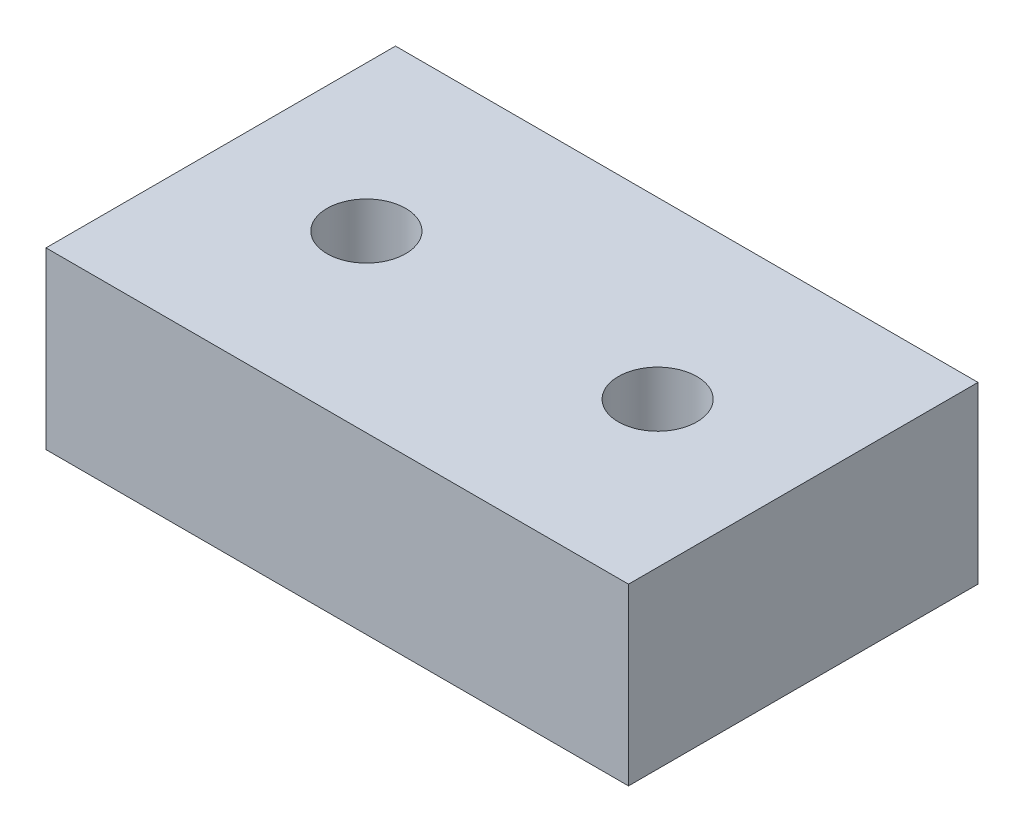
from build123d import *

# Parameters (mm, degrees)
SKIZZE1_W                 = 100
SKIZZE1_H                 = 60
LINEAR_AUSTRAGEN1_DEPTH   = 30
DURCHGANGSLOCH_F_R_M121_D = 13.5


with BuildPart() as part:
    # Skizze1 → Linear austragen1 (new body)
    with BuildSketch(Plane(origin=(0, 0, 0), x_dir=(1, 0, 0), z_dir=(0, 1, 0))):
        with Locations((50, -30)):
            Rectangle(SKIZZE1_W, SKIZZE1_H)
    extrude(amount=LINEAR_AUSTRAGEN1_DEPTH)

    # Durchgangsloch f_r M121 (through all)
    with Locations(Plane.XZ):
        with Locations((75, 30), (25, 30)):
            Hole(DURCHGANGSLOCH_F_R_M121_D / 2)


solid = part.part
